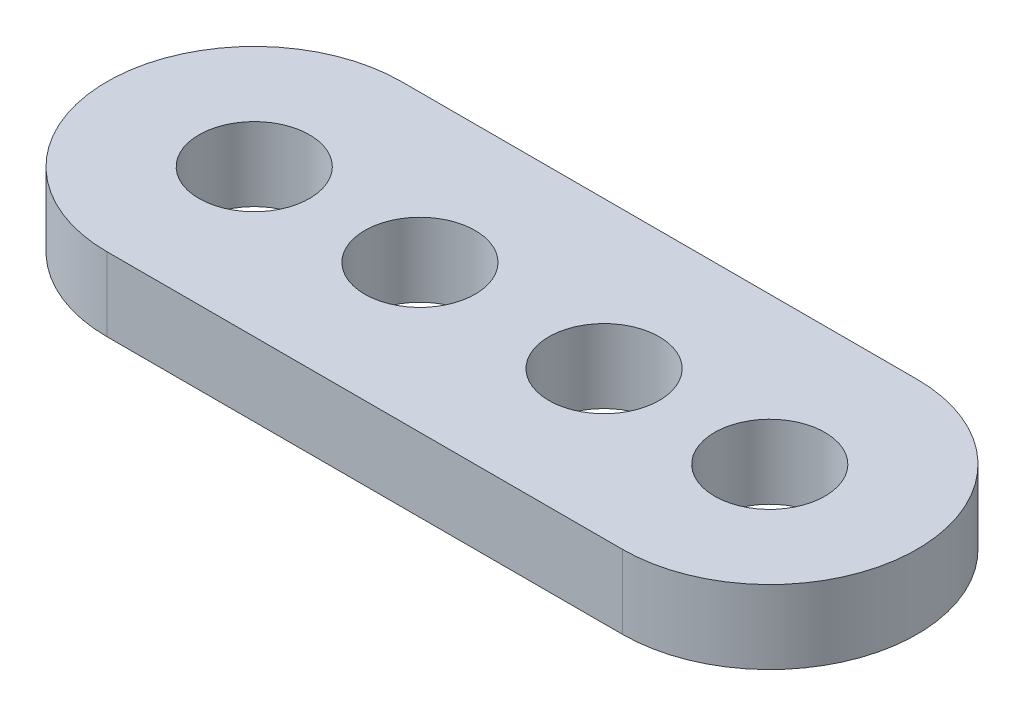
from build123d import *

# Parameters (mm, degrees)
SKETCH_1_R      = 1.5
EXTRUDE_1_DEPTH = 2


with BuildPart() as part:
    # Sketch 1 → Extrude 1 (new body)
    with BuildSketch(Plane(origin=(0, 0, 0), x_dir=(1, 0, 0), z_dir=(0, 1, 0))):
        with BuildLine():
            Line((0, 4), (14, 4))
            ThreePointArc((14, 4), (18, 0), (14, -4))
            Line((14, -4), (0, -4))
            ThreePointArc((0, -4), (-4, 0), (0, 4))
        make_face()
        with Locations(Location((0, 0, 0), (0, 0, 270))):
            Circle(SKETCH_1_R, mode=Mode.SUBTRACT)
        with Locations(Location((14, 0, 0), (0, 0, 270))):
            Circle(SKETCH_1_R, mode=Mode.SUBTRACT)
        with Locations(Location((4.5, 0, 0), (0, 0, 270))):
            Circle(SKETCH_1_R, mode=Mode.SUBTRACT)
        with Locations(Location((9.5, 0, 0), (0, 0, 270))):
            Circle(SKETCH_1_R, mode=Mode.SUBTRACT)
    extrude(amount=EXTRUDE_1_DEPTH)


solid = part.part
